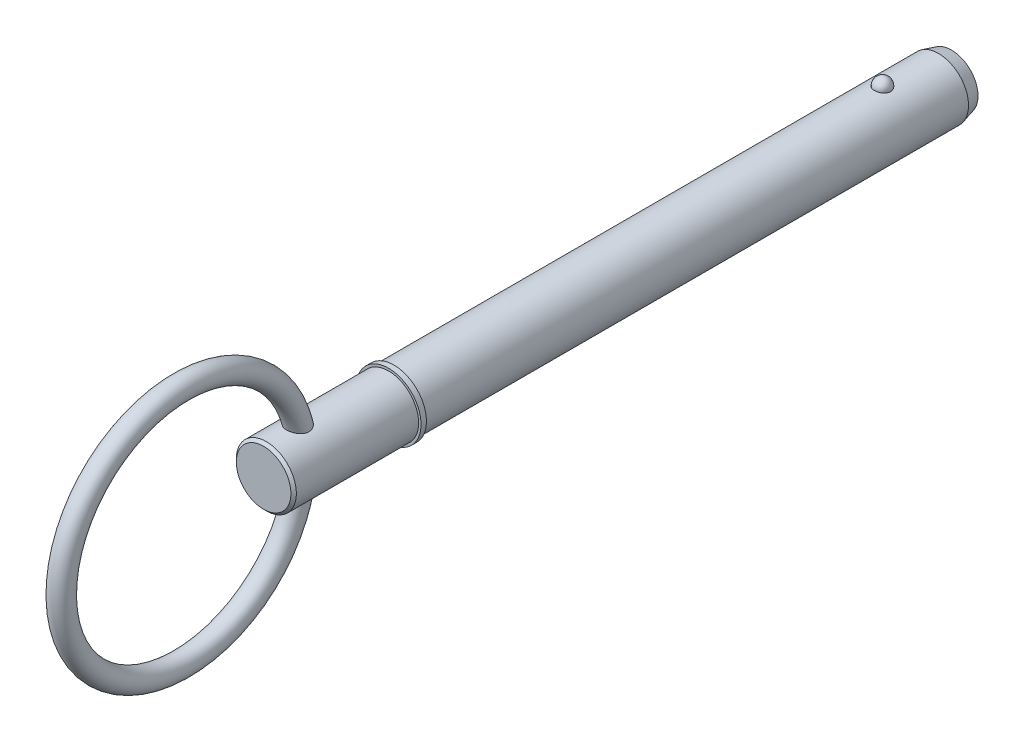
from build123d import *

# Parameters (mm, degrees)
SKETCH2_R           = 5.555
BOSS_EXTRUDE1_DEPTH = 88.9
BOSS_EXTRUDE2_START = 14.27
SKETCH3_R           = 5.555
BOSS_EXTRUDE2_DEPTH = 14.27
CHAMFER1_SIZE       = 2.4
CHAMFER1_SIZE2      = 0.643078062
SKETCH20_W          = 1
SKETCH20_H          = 6
SKETCH21_R          = 5.555
BOSS_EXTRUDE3_DEPTH = 24.13
CHAMFER2_SIZE       = 0.5
SKETCH24_R          = 2


with BuildPart() as part:
    # Sketch2 → Boss-Extrude1 (new body)
    with BuildSketch(Plane.XY):
        Circle(SKETCH2_R)
    extrude(amount=BOSS_EXTRUDE1_DEPTH)

    # Sketch3 → Boss-Extrude2 (add)
    with BuildSketch(Plane(origin=(0, 0, 0), x_dir=(-1, 0, 0), z_dir=(0, 0, -1)).offset(BOSS_EXTRUDE2_START)):
        Circle(SKETCH3_R)
    extrude(amount=-BOSS_EXTRUDE2_DEPTH)

    # Chamfer1
    chamfer1_edges = [part.edges().sort_by_distance(p)[0] for p in [
        (5.555, 0, -14.27),
    ]]
    chamfer1_side = [part.faces().sort_by_distance(p)[0] for p in [
        (5.555, 0, -7.135),
    ]]
    chamfer(chamfer1_edges, length=CHAMFER1_SIZE, length2=CHAMFER1_SIZE2, reference=chamfer1_side[0])

    # Sketch18 → Revolve1 (revolve)
    with BuildSketch(Plane(origin=(0, 0, 0), x_dir=(0, 0, -1), z_dir=(1, 0, 0))):
        with BuildLine():
            Line((1.49, 7.045), (1.49, 4.065))
            ThreePointArc((1.49, 4.065), (0, 5.555), (1.49, 7.045))
        make_face()
    revolve(axis=Axis((0, 7.045, -1.49), (0, -1, 0)))

    # Sketch20 → Revolve2 (revolve)
    with BuildSketch(Plane(origin=(0, 0, 0), x_dir=(0, 0, -1), z_dir=(1, 0, 0)), mode=Mode.PRIVATE) as revolve2_sk:
        with Locations((-89.4, 3)):
            Rectangle(SKETCH20_W, SKETCH20_H)
    revolve(revolve2_sk.sketch.rotate(Axis((0, 0, 33.728787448), (0, 0, 1)), 90), axis=Axis((0, 0, 33.728787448), (0, 0, 1)))

    # Sketch21 → Boss-Extrude3 (add)
    with BuildSketch(Plane(origin=(0, 0, 88.9), x_dir=(-1, 0, 0), z_dir=(0, 0, -1))):
        Circle(SKETCH21_R)
    extrude(amount=-BOSS_EXTRUDE3_DEPTH)

    # Chamfer2
    chamfer2_edges = [part.edges().sort_by_distance(p)[0] for p in [
        (5.555, 0, 113.03),
    ]]
    chamfer(chamfer2_edges, length=CHAMFER2_SIZE)

    # Sweep1: sweep along a path in Sketch23
    with BuildLine(Plane(origin=(0, 0, 0), x_dir=(0, 0, -1), z_dir=(1, 0, 0))) as sweep1_path:
        CenterArc((-128.255, 0), 22.225, 0, 360)
    # Sketch24 → Sweep1 (sweep)
    with BuildSketch(Plane(origin=(0, 0, 0), x_dir=(1, 0, 0), z_dir=(0, 1, 0))):
        with Locations((0, -106.03)):
            Circle(SKETCH24_R)
    sweep(path=sweep1_path.line)


solid = part.part
